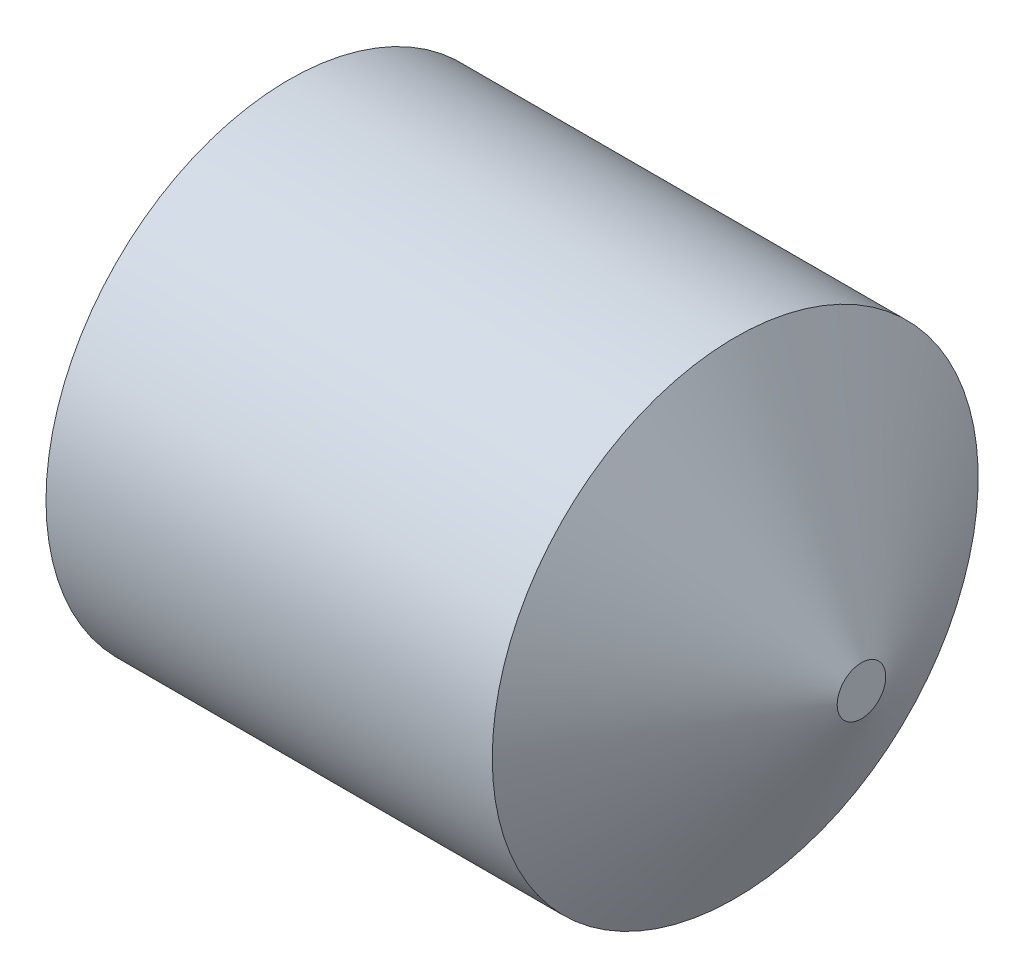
ISO-10303-21;
HEADER;
FILE_DESCRIPTION(('STEP AP214'),'2;1');
FILE_NAME('part.step','',(''),(''),'','','');
FILE_SCHEMA(('AUTOMOTIVE_DESIGN { 1 0 10303 214 1 1 1 1 }'));
ENDSEC;
DATA;
#1=APPLICATION_CONTEXT('core data for automotive mechanical design processes');
#2=APPLICATION_PROTOCOL_DEFINITION('international standard','automotive_design',2000,#1);
#3=PRODUCT_CONTEXT('',#1,'mechanical');
#4=PRODUCT('Part','Part','',(#3));
#5=PRODUCT_RELATED_PRODUCT_CATEGORY('part','',(#4));
#6=PRODUCT_DEFINITION_FORMATION('','',#4);
#7=PRODUCT_DEFINITION_CONTEXT('part definition',#1,'design');
#8=PRODUCT_DEFINITION('design','',#6,#7);
#9=PRODUCT_DEFINITION_SHAPE('','',#8);
#10=(LENGTH_UNIT() NAMED_UNIT(*) SI_UNIT(.MILLI.,.METRE.));
#11=(NAMED_UNIT(*) PLANE_ANGLE_UNIT() SI_UNIT($,.RADIAN.));
#12=(NAMED_UNIT(*) SI_UNIT($,.STERADIAN.) SOLID_ANGLE_UNIT());
#13=UNCERTAINTY_MEASURE_WITH_UNIT(LENGTH_MEASURE(1.E-05),#10,'distance_accuracy_value','');
#14=(GEOMETRIC_REPRESENTATION_CONTEXT(3) GLOBAL_UNCERTAINTY_ASSIGNED_CONTEXT((#13)) GLOBAL_UNIT_ASSIGNED_CONTEXT((#10,
#11,#12)) REPRESENTATION_CONTEXT('',''));
#15=CARTESIAN_POINT('',(0.,0.,0.));
#16=DIRECTION('',(0.,0.,1.));
#17=DIRECTION('',(1.,0.,0.));
#18=AXIS2_PLACEMENT_3D('',#15,#16,#17);
#19=CARTESIAN_POINT('',(0.,0.,0.));
#20=DIRECTION('',(-1.,0.,0.));
#21=DIRECTION('',(0.,0.,1.));
#22=AXIS2_PLACEMENT_3D('',#19,#20,#21);
#23=CYLINDRICAL_SURFACE('',#22,0.799999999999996);
#24=CARTESIAN_POINT('',(1.58430780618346,0.,0.));
#25=DIRECTION('',(-1.,0.,0.));
#26=DIRECTION('',(0.,0.,1.));
#27=AXIS2_PLACEMENT_3D('',#24,#25,#26);
#28=CIRCLE('',#27,0.8);
#29=CARTESIAN_POINT('',(1.58430780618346,0.,0.8));
#30=VERTEX_POINT('',#29);
#31=EDGE_CURVE('E11',#30,#30,#28,.T.);
#32=ORIENTED_EDGE('',*,*,#31,.T.);
#33=EDGE_LOOP('',(#32));
#34=FACE_BOUND('',#33,.T.);
#35=CARTESIAN_POINT('',(0.114892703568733,0.,0.));
#36=DIRECTION('',(-1.,0.,0.));
#37=DIRECTION('',(0.,0.,1.));
#38=AXIS2_PLACEMENT_3D('',#35,#36,#37);
#39=CIRCLE('',#38,0.799999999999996);
#40=CARTESIAN_POINT('',(0.114892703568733,0.,0.799999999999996));
#41=VERTEX_POINT('',#40);
#42=EDGE_CURVE('E155',#41,#41,#39,.T.);
#43=ORIENTED_EDGE('',*,*,#42,.F.);
#44=EDGE_LOOP('',(#43));
#45=FACE_BOUND('',#44,.T.);
#46=ADVANCED_FACE('F45',(#34,#45),#23,.T.);
#47=CARTESIAN_POINT('',(2.,0.,0.));
#48=DIRECTION('',(-1.,0.,0.));
#49=DIRECTION('',(0.,0.,1.));
#50=AXIS2_PLACEMENT_3D('',#47,#48,#49);
#51=CONICAL_SURFACE('',#50,0.08,1.04719755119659);
#52=CARTESIAN_POINT('',(2.,0.,0.));
#53=DIRECTION('',(-1.,0.,0.));
#54=DIRECTION('',(0.,0.,1.));
#55=AXIS2_PLACEMENT_3D('',#52,#53,#54);
#56=CIRCLE('',#55,0.08);
#57=CARTESIAN_POINT('',(2.,0.,0.0799999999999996));
#58=VERTEX_POINT('',#57);
#59=EDGE_CURVE('E53',#58,#58,#56,.T.);
#60=CARTESIAN_POINT('',(1.58430780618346,0.,0.8));
#61=CARTESIAN_POINT('',(1.58863793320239,0.,0.7925));
#62=CARTESIAN_POINT('',(1.59296806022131,0.,0.785));
#63=CARTESIAN_POINT('',(1.60162831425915,0.,0.77));
#64=CARTESIAN_POINT('',(1.60595844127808,0.,0.7625));
#65=CARTESIAN_POINT('',(1.61461869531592,0.,0.7475));
#66=CARTESIAN_POINT('',(1.61894882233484,0.,0.74));
#67=CARTESIAN_POINT('',(1.62760907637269,0.,0.725));
#68=CARTESIAN_POINT('',(1.63193920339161,0.,0.7175));
#69=CARTESIAN_POINT('',(1.64059945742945,0.,0.7025));
#70=CARTESIAN_POINT('',(1.64492958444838,0.,0.695));
#71=CARTESIAN_POINT('',(1.65358983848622,0.,0.68));
#72=CARTESIAN_POINT('',(1.65791996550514,0.,0.6725));
#73=CARTESIAN_POINT('',(1.66658021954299,0.,0.6575));
#74=CARTESIAN_POINT('',(1.67091034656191,0.,0.65));
#75=CARTESIAN_POINT('',(1.67957060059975,0.,0.635));
#76=CARTESIAN_POINT('',(1.68390072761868,0.,0.6275));
#77=CARTESIAN_POINT('',(1.69256098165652,0.,0.6125));
#78=CARTESIAN_POINT('',(1.69689110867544,0.,0.605));
#79=CARTESIAN_POINT('',(1.70555136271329,0.,0.59));
#80=CARTESIAN_POINT('',(1.70988148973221,0.,0.5825));
#81=CARTESIAN_POINT('',(1.71854174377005,0.,0.5675));
#82=CARTESIAN_POINT('',(1.72287187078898,0.,0.56));
#83=CARTESIAN_POINT('',(1.73153212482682,0.,0.545));
#84=CARTESIAN_POINT('',(1.73586225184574,0.,0.5375));
#85=CARTESIAN_POINT('',(1.74452250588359,0.,0.5225));
#86=CARTESIAN_POINT('',(1.74885263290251,0.,0.515));
#87=CARTESIAN_POINT('',(1.75751288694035,0.,0.5));
#88=CARTESIAN_POINT('',(1.76184301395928,0.,0.4925));
#89=CARTESIAN_POINT('',(1.77050326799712,0.,0.4775));
#90=CARTESIAN_POINT('',(1.77483339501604,0.,0.47));
#91=CARTESIAN_POINT('',(1.78349364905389,0.,0.455));
#92=CARTESIAN_POINT('',(1.78782377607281,0.,0.4475));
#93=CARTESIAN_POINT('',(1.79648403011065,0.,0.4325));
#94=CARTESIAN_POINT('',(1.80081415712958,0.,0.425));
#95=CARTESIAN_POINT('',(1.80947441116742,0.,0.41));
#96=CARTESIAN_POINT('',(1.81380453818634,0.,0.4025));
#97=CARTESIAN_POINT('',(1.82246479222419,0.,0.3875));
#98=CARTESIAN_POINT('',(1.82679491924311,0.,0.38));
#99=CARTESIAN_POINT('',(1.83545517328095,0.,0.365));
#100=CARTESIAN_POINT('',(1.83978530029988,0.,0.3575));
#101=CARTESIAN_POINT('',(1.84844555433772,0.,0.3425));
#102=CARTESIAN_POINT('',(1.85277568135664,0.,0.335));
#103=CARTESIAN_POINT('',(1.86143593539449,0.,0.32));
#104=CARTESIAN_POINT('',(1.86576606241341,0.,0.3125));
#105=CARTESIAN_POINT('',(1.87442631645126,0.,0.2975));
#106=CARTESIAN_POINT('',(1.87875644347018,0.,0.29));
#107=CARTESIAN_POINT('',(1.88741669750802,0.,0.275));
#108=CARTESIAN_POINT('',(1.89174682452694,0.,0.2675));
#109=CARTESIAN_POINT('',(1.90040707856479,0.,0.2525));
#110=CARTESIAN_POINT('',(1.90473720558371,0.,0.245));
#111=CARTESIAN_POINT('',(1.91339745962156,0.,0.23));
#112=CARTESIAN_POINT('',(1.91772758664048,0.,0.2225));
#113=CARTESIAN_POINT('',(1.92638784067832,0.,0.2075));
#114=CARTESIAN_POINT('',(1.93071796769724,0.,0.2));
#115=CARTESIAN_POINT('',(1.93937822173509,0.,0.185));
#116=CARTESIAN_POINT('',(1.94370834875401,0.,0.1775));
#117=CARTESIAN_POINT('',(1.95236860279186,0.,0.1625));
#118=CARTESIAN_POINT('',(1.95669872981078,0.,0.155));
#119=CARTESIAN_POINT('',(1.96535898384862,0.,0.14));
#120=CARTESIAN_POINT('',(1.96968911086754,0.,0.1325));
#121=CARTESIAN_POINT('',(1.97834936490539,0.,0.1175));
#122=CARTESIAN_POINT('',(1.98267949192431,0.,0.11));
#123=CARTESIAN_POINT('',(1.99133974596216,0.,0.0949999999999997));
#124=CARTESIAN_POINT('',(1.99566987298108,0.,0.0874999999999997));
#125=CARTESIAN_POINT('',(2.,0.,0.0799999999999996));
#126=B_SPLINE_CURVE_WITH_KNOTS('',3,(#60,#61,#62,#63,#64,#65,#66,#67,#68,#69,#70,#71,#72,#73,
#74,#75,#76,#77,#78,#79,#80,#81,#82,#83,#84,#85,#86,#87,#88,#89,#90,#91,#92,#93,#94,#95,#96,#97,
#98,#99,#100,#101,#102,#103,#104,#105,#106,#107,#108,#109,#110,#111,#112,#113,#114,#115,#116,
#117,#118,#119,#120,#121,#122,#123,#124,#125),.UNSPECIFIED.,.F.,.F.,(4,2,2,2,2,2,2,2,2,2,2,2,2,
2,2,2,2,2,2,2,2,2,2,2,2,2,2,2,2,2,2,2,4),(0.,0.0259807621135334,0.0519615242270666,
0.0779422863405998,0.103923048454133,0.129903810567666,0.1558845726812,0.181865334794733,
0.207846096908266,0.233826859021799,0.259807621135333,0.285788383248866,0.311769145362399,
0.337749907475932,0.363730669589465,0.389711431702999,0.415692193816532,0.441672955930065,
0.467653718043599,0.493634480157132,0.519615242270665,0.545596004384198,0.571576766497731,
0.597557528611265,0.623538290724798,0.649519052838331,0.675499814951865,0.701480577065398,
0.727461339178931,0.753442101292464,0.779422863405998,0.805403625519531,0.831384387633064),.UNSPECIFIED.);
#127=EDGE_CURVE('BSEAM160',#30,#58,#126,.T.);
#128=ORIENTED_EDGE('',*,*,#31,.F.);
#129=ORIENTED_EDGE('',*,*,#59,.T.);
#130=ORIENTED_EDGE('',*,*,#127,.T.);
#131=ORIENTED_EDGE('',*,*,#127,.F.);
#132=EDGE_LOOP('',(#128,#130,#129,#131));
#133=FACE_BOUND('',#132,.T.);
#134=ADVANCED_FACE('F160',(#133),#51,.T.);
#135=CARTESIAN_POINT('',(2.,0.,0.));
#136=DIRECTION('',(-1.,0.,0.));
#137=DIRECTION('',(0.,0.,1.));
#138=AXIS2_PLACEMENT_3D('',#135,#136,#137);
#139=PLANE('',#138);
#140=ORIENTED_EDGE('',*,*,#59,.F.);
#141=EDGE_LOOP('',(#140));
#142=FACE_BOUND('',#141,.T.);
#143=ADVANCED_FACE('F162',(#142),#139,.F.);
#144=CARTESIAN_POINT('',(0.,0.,0.));
#145=DIRECTION('',(1.,0.,0.));
#146=DIRECTION('',(0.,0.,-1.));
#147=AXIS2_PLACEMENT_3D('',#144,#145,#146);
#148=CONICAL_SURFACE('',#147,0.601,1.0471975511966);
#149=ORIENTED_EDGE('',*,*,#42,.T.);
#150=EDGE_LOOP('',(#149));
#151=FACE_BOUND('',#150,.T.);
#152=CARTESIAN_POINT('',(0.,0.,0.));
#153=DIRECTION('',(-1.,0.,0.));
#154=DIRECTION('',(0.,0.,1.));
#155=AXIS2_PLACEMENT_3D('',#152,#153,#154);
#156=CIRCLE('',#155,0.601);
#157=CARTESIAN_POINT('',(0.,0.,0.601));
#158=VERTEX_POINT('',#157);
#159=EDGE_CURVE('E147',#158,#158,#156,.T.);
#160=ORIENTED_EDGE('',*,*,#159,.F.);
#161=EDGE_LOOP('',(#160));
#162=FACE_BOUND('',#161,.T.);
#163=ADVANCED_FACE('F164',(#151,#162),#148,.T.);
#164=CARTESIAN_POINT('',(0.,0.799999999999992,0.));
#165=DIRECTION('',(1.,0.,0.));
#166=DIRECTION('',(0.,0.,-1.));
#167=AXIS2_PLACEMENT_3D('',#164,#165,#166);
#168=PLANE('',#167);
#169=DIRECTION('',(0.,-0.5,-0.866025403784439));
#170=VECTOR('',#169,1.);
#171=CARTESIAN_POINT('',(0.,0.404145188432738,0.));
#172=LINE('',#171,#170);
#173=CARTESIAN_POINT('',(0.,0.404145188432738,0.));
#174=VERTEX_POINT('',#173);
#175=CARTESIAN_POINT('',(0.,0.202072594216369,-0.35));
#176=VERTEX_POINT('',#175);
#177=EDGE_CURVE('E134',#174,#176,#172,.T.);
#178=ORIENTED_EDGE('',*,*,#177,.F.);
#179=DIRECTION('',(0.,0.5,-0.866025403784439));
#180=VECTOR('',#179,1.);
#181=CARTESIAN_POINT('',(0.,0.202072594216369,0.35));
#182=LINE('',#181,#180);
#183=CARTESIAN_POINT('',(0.,0.202072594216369,0.35));
#184=VERTEX_POINT('',#183);
#185=EDGE_CURVE('E60',#184,#174,#182,.T.);
#186=ORIENTED_EDGE('',*,*,#185,.F.);
#187=DIRECTION('',(0.,1.,0.));
#188=VECTOR('',#187,1.);
#189=CARTESIAN_POINT('',(0.,-0.202072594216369,0.35));
#190=LINE('',#189,#188);
#191=CARTESIAN_POINT('',(0.,-0.202072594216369,0.35));
#192=VERTEX_POINT('',#191);
#193=EDGE_CURVE('E143',#192,#184,#190,.T.);
#194=ORIENTED_EDGE('',*,*,#193,.F.);
#195=DIRECTION('',(0.,0.5,0.866025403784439));
#196=VECTOR('',#195,1.);
#197=CARTESIAN_POINT('',(0.,-0.404145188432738,0.));
#198=LINE('',#197,#196);
#199=CARTESIAN_POINT('',(0.,-0.404145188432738,0.));
#200=VERTEX_POINT('',#199);
#201=EDGE_CURVE('E141',#200,#192,#198,.T.);
#202=ORIENTED_EDGE('',*,*,#201,.F.);
#203=DIRECTION('',(0.,-0.5,0.866025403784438));
#204=VECTOR('',#203,1.);
#205=CARTESIAN_POINT('',(0.,-0.202072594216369,-0.35));
#206=LINE('',#205,#204);
#207=CARTESIAN_POINT('',(0.,-0.202072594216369,-0.35));
#208=VERTEX_POINT('',#207);
#209=EDGE_CURVE('E108',#208,#200,#206,.T.);
#210=ORIENTED_EDGE('',*,*,#209,.F.);
#211=DIRECTION('',(0.,-1.,0.));
#212=VECTOR('',#211,1.);
#213=CARTESIAN_POINT('',(0.,0.202072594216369,-0.35));
#214=LINE('',#213,#212);
#215=EDGE_CURVE('E137',#176,#208,#214,.T.);
#216=ORIENTED_EDGE('',*,*,#215,.F.);
#217=EDGE_LOOP('',(#178,#186,#194,#202,#210,#216));
#218=FACE_BOUND('',#217,.T.);
#219=ORIENTED_EDGE('',*,*,#159,.T.);
#220=EDGE_LOOP('',(#219));
#221=FACE_BOUND('',#220,.T.);
#222=ADVANCED_FACE('F47',(#218,#221),#168,.F.);
#223=CARTESIAN_POINT('',(0.7,0.202072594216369,0.35));
#224=DIRECTION('',(0.,0.866025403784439,0.5));
#225=DIRECTION('',(0.,-0.5,0.866025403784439));
#226=AXIS2_PLACEMENT_3D('',#223,#224,#225);
#227=PLANE('',#226);
#228=ORIENTED_EDGE('',*,*,#185,.T.);
#229=DIRECTION('',(-1.,0.,0.));
#230=VECTOR('',#229,1.);
#231=CARTESIAN_POINT('',(0.7,0.404145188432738,0.));
#232=LINE('',#231,#230);
#233=CARTESIAN_POINT('',(0.7,0.404145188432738,0.));
#234=VERTEX_POINT('',#233);
#235=EDGE_CURVE('E90',#234,#174,#232,.T.);
#236=ORIENTED_EDGE('',*,*,#235,.F.);
#237=DIRECTION('',(0.,0.5,-0.866025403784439));
#238=VECTOR('',#237,1.);
#239=CARTESIAN_POINT('',(0.7,0.202072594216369,0.35));
#240=LINE('',#239,#238);
#241=CARTESIAN_POINT('',(0.7,0.202072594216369,0.35));
#242=VERTEX_POINT('',#241);
#243=EDGE_CURVE('E145',#242,#234,#240,.T.);
#244=ORIENTED_EDGE('',*,*,#243,.F.);
#245=DIRECTION('',(-1.,0.,0.));
#246=VECTOR('',#245,1.);
#247=CARTESIAN_POINT('',(0.7,0.202072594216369,0.35));
#248=LINE('',#247,#246);
#249=EDGE_CURVE('E68',#242,#184,#248,.T.);
#250=ORIENTED_EDGE('',*,*,#249,.T.);
#251=EDGE_LOOP('',(#228,#236,#244,#250));
#252=FACE_BOUND('',#251,.T.);
#253=ADVANCED_FACE('F186',(#252),#227,.F.);
#254=CARTESIAN_POINT('',(0.7,-0.202072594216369,0.35));
#255=DIRECTION('',(0.,0.,1.));
#256=DIRECTION('',(0.,-1.,0.));
#257=AXIS2_PLACEMENT_3D('',#254,#255,#256);
#258=PLANE('',#257);
#259=ORIENTED_EDGE('',*,*,#193,.T.);
#260=ORIENTED_EDGE('',*,*,#249,.F.);
#261=DIRECTION('',(0.,1.,0.));
#262=VECTOR('',#261,1.);
#263=CARTESIAN_POINT('',(0.7,-0.202072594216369,0.35));
#264=LINE('',#263,#262);
#265=CARTESIAN_POINT('',(0.7,-0.202072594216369,0.35));
#266=VERTEX_POINT('',#265);
#267=EDGE_CURVE('E120',#266,#242,#264,.T.);
#268=ORIENTED_EDGE('',*,*,#267,.F.);
#269=DIRECTION('',(-1.,0.,0.));
#270=VECTOR('',#269,1.);
#271=CARTESIAN_POINT('',(0.7,-0.202072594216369,0.35));
#272=LINE('',#271,#270);
#273=EDGE_CURVE('E112',#266,#192,#272,.T.);
#274=ORIENTED_EDGE('',*,*,#273,.T.);
#275=EDGE_LOOP('',(#259,#260,#268,#274));
#276=FACE_BOUND('',#275,.T.);
#277=ADVANCED_FACE('F191',(#276),#258,.F.);
#278=CARTESIAN_POINT('',(0.7,-0.404145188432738,0.));
#279=DIRECTION('',(0.,-0.866025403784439,0.5));
#280=DIRECTION('',(0.,-0.5,-0.866025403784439));
#281=AXIS2_PLACEMENT_3D('',#278,#279,#280);
#282=PLANE('',#281);
#283=ORIENTED_EDGE('',*,*,#201,.T.);
#284=ORIENTED_EDGE('',*,*,#273,.F.);
#285=DIRECTION('',(0.,0.5,0.866025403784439));
#286=VECTOR('',#285,1.);
#287=CARTESIAN_POINT('',(0.7,-0.404145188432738,0.));
#288=LINE('',#287,#286);
#289=CARTESIAN_POINT('',(0.7,-0.404145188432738,0.));
#290=VERTEX_POINT('',#289);
#291=EDGE_CURVE('E116',#290,#266,#288,.T.);
#292=ORIENTED_EDGE('',*,*,#291,.F.);
#293=DIRECTION('',(-1.,0.,0.));
#294=VECTOR('',#293,1.);
#295=CARTESIAN_POINT('',(0.7,-0.404145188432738,0.));
#296=LINE('',#295,#294);
#297=EDGE_CURVE('E101',#290,#200,#296,.T.);
#298=ORIENTED_EDGE('',*,*,#297,.T.);
#299=EDGE_LOOP('',(#283,#284,#292,#298));
#300=FACE_BOUND('',#299,.T.);
#301=ADVANCED_FACE('F117',(#300),#282,.F.);
#302=CARTESIAN_POINT('',(0.7,-0.202072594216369,-0.35));
#303=DIRECTION('',(0.,-0.866025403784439,-0.5));
#304=DIRECTION('',(0.,0.5,-0.866025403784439));
#305=AXIS2_PLACEMENT_3D('',#302,#303,#304);
#306=PLANE('',#305);
#307=ORIENTED_EDGE('',*,*,#209,.T.);
#308=ORIENTED_EDGE('',*,*,#297,.F.);
#309=DIRECTION('',(0.,-0.5,0.866025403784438));
#310=VECTOR('',#309,1.);
#311=CARTESIAN_POINT('',(0.7,-0.202072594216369,-0.35));
#312=LINE('',#311,#310);
#313=CARTESIAN_POINT('',(0.7,-0.202072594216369,-0.35));
#314=VERTEX_POINT('',#313);
#315=EDGE_CURVE('E105',#314,#290,#312,.T.);
#316=ORIENTED_EDGE('',*,*,#315,.F.);
#317=DIRECTION('',(-1.,0.,0.));
#318=VECTOR('',#317,1.);
#319=CARTESIAN_POINT('',(0.7,-0.202072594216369,-0.35));
#320=LINE('',#319,#318);
#321=EDGE_CURVE('E113',#314,#208,#320,.T.);
#322=ORIENTED_EDGE('',*,*,#321,.T.);
#323=EDGE_LOOP('',(#307,#308,#316,#322));
#324=FACE_BOUND('',#323,.T.);
#325=ADVANCED_FACE('F103',(#324),#306,.F.);
#326=CARTESIAN_POINT('',(0.7,0.202072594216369,-0.35));
#327=DIRECTION('',(0.,0.,-1.));
#328=DIRECTION('',(-1.,0.,0.));
#329=AXIS2_PLACEMENT_3D('',#326,#327,#328);
#330=PLANE('',#329);
#331=ORIENTED_EDGE('',*,*,#215,.T.);
#332=ORIENTED_EDGE('',*,*,#321,.F.);
#333=DIRECTION('',(0.,-1.,0.));
#334=VECTOR('',#333,1.);
#335=CARTESIAN_POINT('',(0.7,0.202072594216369,-0.35));
#336=LINE('',#335,#334);
#337=CARTESIAN_POINT('',(0.7,0.202072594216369,-0.35));
#338=VERTEX_POINT('',#337);
#339=EDGE_CURVE('E126',#338,#314,#336,.T.);
#340=ORIENTED_EDGE('',*,*,#339,.F.);
#341=DIRECTION('',(-1.,0.,0.));
#342=VECTOR('',#341,1.);
#343=CARTESIAN_POINT('',(0.7,0.202072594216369,-0.35));
#344=LINE('',#343,#342);
#345=EDGE_CURVE('E150',#338,#176,#344,.T.);
#346=ORIENTED_EDGE('',*,*,#345,.T.);
#347=EDGE_LOOP('',(#331,#332,#340,#346));
#348=FACE_BOUND('',#347,.T.);
#349=ADVANCED_FACE('F209',(#348),#330,.F.);
#350=CARTESIAN_POINT('',(0.7,0.404145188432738,0.));
#351=DIRECTION('',(0.,0.866025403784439,-0.5));
#352=DIRECTION('',(0.,0.5,0.866025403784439));
#353=AXIS2_PLACEMENT_3D('',#350,#351,#352);
#354=PLANE('',#353);
#355=ORIENTED_EDGE('',*,*,#177,.T.);
#356=ORIENTED_EDGE('',*,*,#345,.F.);
#357=DIRECTION('',(0.,-0.5,-0.866025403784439));
#358=VECTOR('',#357,1.);
#359=CARTESIAN_POINT('',(0.7,0.404145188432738,0.));
#360=LINE('',#359,#358);
#361=EDGE_CURVE('E128',#234,#338,#360,.T.);
#362=ORIENTED_EDGE('',*,*,#361,.F.);
#363=ORIENTED_EDGE('',*,*,#235,.T.);
#364=EDGE_LOOP('',(#355,#356,#362,#363));
#365=FACE_BOUND('',#364,.T.);
#366=ADVANCED_FACE('F197',(#365),#354,.F.);
#367=CARTESIAN_POINT('',(0.7,0.202072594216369,0.35));
#368=DIRECTION('',(1.,0.,0.));
#369=DIRECTION('',(0.,0.,-1.));
#370=AXIS2_PLACEMENT_3D('',#367,#368,#369);
#371=PLANE('',#370);
#372=ORIENTED_EDGE('',*,*,#243,.T.);
#373=ORIENTED_EDGE('',*,*,#361,.T.);
#374=ORIENTED_EDGE('',*,*,#339,.T.);
#375=ORIENTED_EDGE('',*,*,#315,.T.);
#376=ORIENTED_EDGE('',*,*,#291,.T.);
#377=ORIENTED_EDGE('',*,*,#267,.T.);
#378=EDGE_LOOP('',(#372,#373,#374,#375,#376,#377));
#379=FACE_BOUND('',#378,.T.);
#380=ADVANCED_FACE('F123',(#379),#371,.F.);
#381=CLOSED_SHELL('',(#46,#134,#143,#163,#222,#253,#277,#301,#325,#349,#366,#380));
#382=MANIFOLD_SOLID_BREP('B2',#381);
#383=ADVANCED_BREP_SHAPE_REPRESENTATION('',(#18,#382),#14);
#384=SHAPE_DEFINITION_REPRESENTATION(#9,#383);
ENDSEC;
END-ISO-10303-21;
